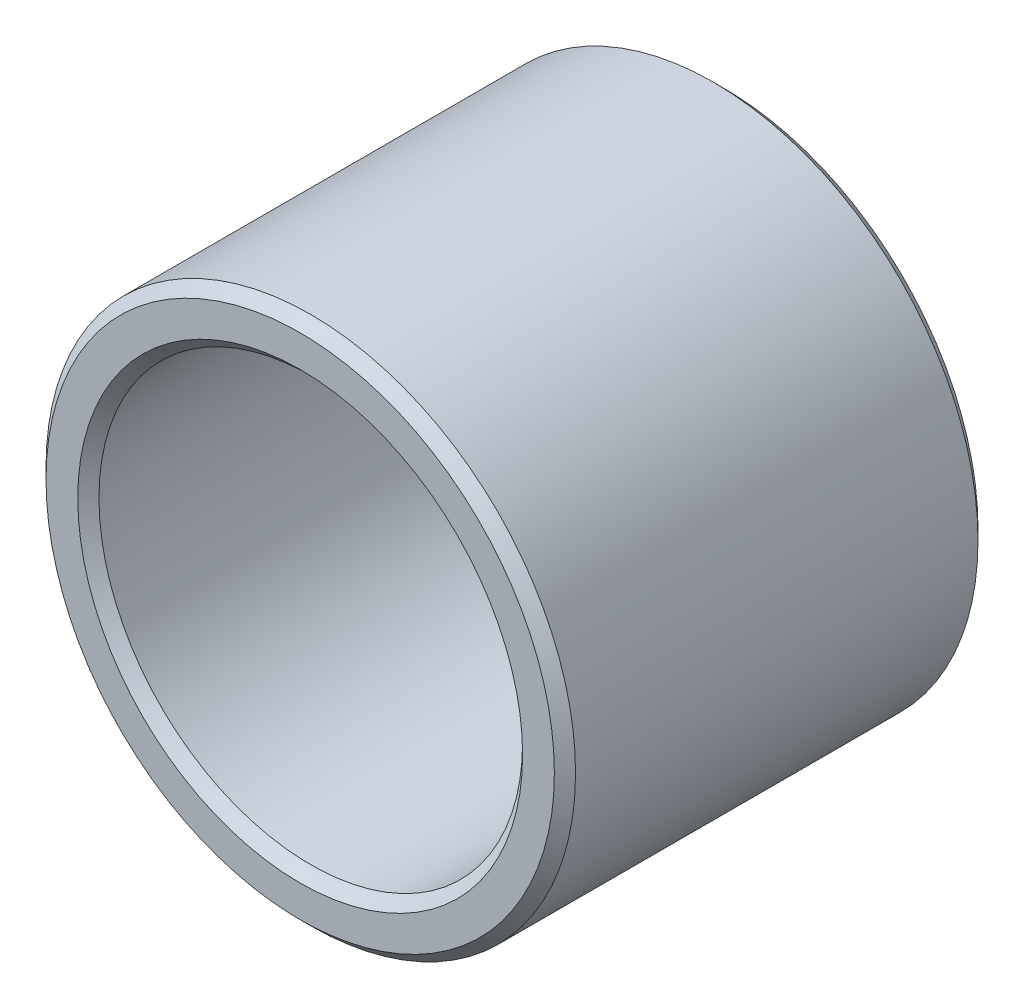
from build123d import *

# Parameters (mm, degrees)
ESQUISSE1_R      = 25
ESQUISSE1_R_2    = 20
EXTRUSION1_DEPTH = 40
CHANFREIN1_SIZE  = 1


with BuildPart() as part:
    # Esquisse1 → Extrusion1 (new body)
    with BuildSketch(Plane.XY):
        Circle(ESQUISSE1_R)
        Circle(ESQUISSE1_R_2, mode=Mode.SUBTRACT)
    extrude(amount=EXTRUSION1_DEPTH)

    # Chanfrein1
    chanfrein1_edges = [part.edges().sort_by_distance(p)[0] for p in [
        (-25, 0, 0),
        (-25, 0, 40),
        (-20, 0, 0),
        (-20, 0, 40),
    ]]
    chamfer(chanfrein1_edges, length=CHANFREIN1_SIZE)


solid = part.part
